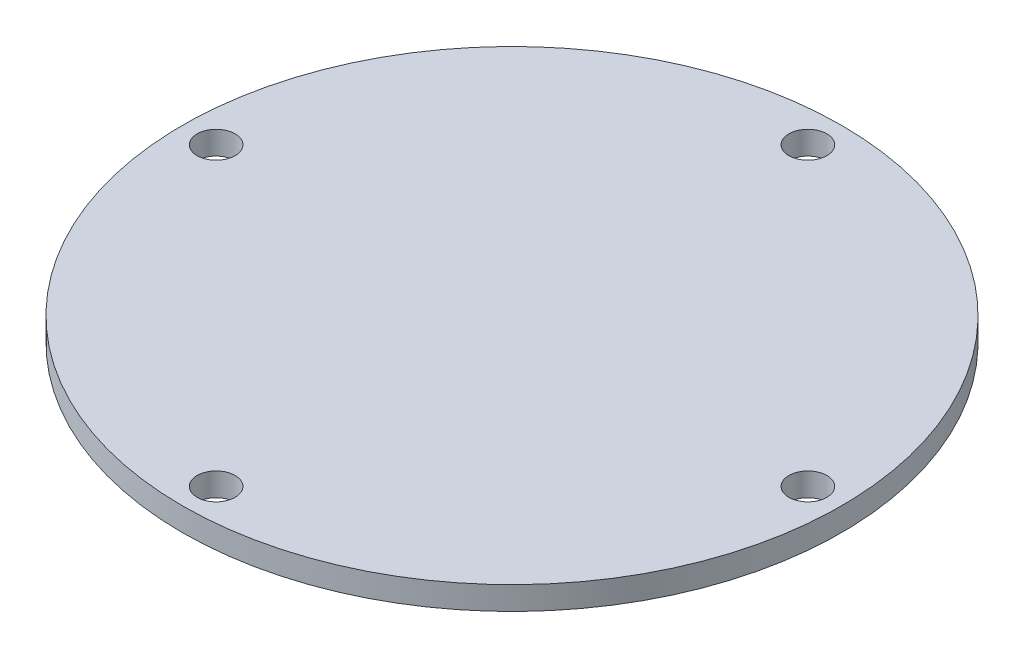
ISO-10303-21;
HEADER;
FILE_DESCRIPTION(('STEP AP214'),'2;1');
FILE_NAME('part.step','',(''),(''),'','','');
FILE_SCHEMA(('AUTOMOTIVE_DESIGN { 1 0 10303 214 1 1 1 1 }'));
ENDSEC;
DATA;
#1=APPLICATION_CONTEXT('core data for automotive mechanical design processes');
#2=APPLICATION_PROTOCOL_DEFINITION('international standard','automotive_design',2000,#1);
#3=PRODUCT_CONTEXT('',#1,'mechanical');
#4=PRODUCT('Part','Part','',(#3));
#5=PRODUCT_RELATED_PRODUCT_CATEGORY('part','',(#4));
#6=PRODUCT_DEFINITION_FORMATION('','',#4);
#7=PRODUCT_DEFINITION_CONTEXT('part definition',#1,'design');
#8=PRODUCT_DEFINITION('design','',#6,#7);
#9=PRODUCT_DEFINITION_SHAPE('','',#8);
#10=(LENGTH_UNIT() NAMED_UNIT(*) SI_UNIT(.MILLI.,.METRE.));
#11=(NAMED_UNIT(*) PLANE_ANGLE_UNIT() SI_UNIT($,.RADIAN.));
#12=(NAMED_UNIT(*) SI_UNIT($,.STERADIAN.) SOLID_ANGLE_UNIT());
#13=UNCERTAINTY_MEASURE_WITH_UNIT(LENGTH_MEASURE(1.E-05),#10,'distance_accuracy_value','');
#14=(GEOMETRIC_REPRESENTATION_CONTEXT(3) GLOBAL_UNCERTAINTY_ASSIGNED_CONTEXT((#13)) GLOBAL_UNIT_ASSIGNED_CONTEXT((#10,
#11,#12)) REPRESENTATION_CONTEXT('',''));
#15=CARTESIAN_POINT('',(0.,0.,0.));
#16=DIRECTION('',(0.,0.,1.));
#17=DIRECTION('',(1.,0.,0.));
#18=AXIS2_PLACEMENT_3D('',#15,#16,#17);
#19=CARTESIAN_POINT('',(0.,3.175,0.));
#20=DIRECTION('',(0.,-1.,0.));
#21=DIRECTION('',(0.,0.,-1.));
#22=AXIS2_PLACEMENT_3D('',#19,#20,#21);
#23=CYLINDRICAL_SURFACE('',#22,45.);
#24=CARTESIAN_POINT('',(0.,3.175,0.));
#25=DIRECTION('',(0.,1.,0.));
#26=DIRECTION('',(0.,0.,1.));
#27=AXIS2_PLACEMENT_3D('',#24,#25,#26);
#28=CIRCLE('',#27,45.);
#29=CARTESIAN_POINT('',(0.,3.175,45.));
#30=VERTEX_POINT('',#29);
#31=EDGE_CURVE('E10',#30,#30,#28,.T.);
#32=ORIENTED_EDGE('',*,*,#31,.F.);
#33=EDGE_LOOP('',(#32));
#34=FACE_BOUND('',#33,.T.);
#35=CARTESIAN_POINT('',(0.,0.,0.));
#36=DIRECTION('',(0.,1.,0.));
#37=DIRECTION('',(0.,0.,1.));
#38=AXIS2_PLACEMENT_3D('',#35,#36,#37);
#39=CIRCLE('',#38,45.);
#40=CARTESIAN_POINT('',(0.,0.,45.));
#41=VERTEX_POINT('',#40);
#42=EDGE_CURVE('E37',#41,#41,#39,.T.);
#43=ORIENTED_EDGE('',*,*,#42,.T.);
#44=EDGE_LOOP('',(#43));
#45=FACE_BOUND('',#44,.T.);
#46=ADVANCED_FACE('F30',(#34,#45),#23,.T.);
#47=CARTESIAN_POINT('',(0.,3.175,0.));
#48=DIRECTION('',(0.,1.,0.));
#49=DIRECTION('',(0.,0.,1.));
#50=AXIS2_PLACEMENT_3D('',#47,#48,#49);
#51=PLANE('',#50);
#52=CARTESIAN_POINT('',(4.23167538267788E-13,3.175,-40.4));
#53=DIRECTION('',(0.,1.,0.));
#54=DIRECTION('',(0.,0.,1.));
#55=AXIS2_PLACEMENT_3D('',#52,#53,#54);
#56=CIRCLE('',#55,2.59079999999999);
#57=CARTESIAN_POINT('',(4.23167538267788E-13,3.175,-37.8092));
#58=VERTEX_POINT('',#57);
#59=EDGE_CURVE('E60',#58,#58,#56,.T.);
#60=ORIENTED_EDGE('',*,*,#59,.F.);
#61=EDGE_LOOP('',(#60));
#62=FACE_BOUND('',#61,.T.);
#63=CARTESIAN_POINT('',(-40.4,3.175,0.));
#64=DIRECTION('',(0.,1.,0.));
#65=DIRECTION('',(0.,0.,1.));
#66=AXIS2_PLACEMENT_3D('',#63,#64,#65);
#67=CIRCLE('',#66,2.59079999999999);
#68=CARTESIAN_POINT('',(-40.4,3.175,2.59079999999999));
#69=VERTEX_POINT('',#68);
#70=EDGE_CURVE('E49',#69,#69,#67,.T.);
#71=ORIENTED_EDGE('',*,*,#70,.F.);
#72=EDGE_LOOP('',(#71));
#73=FACE_BOUND('',#72,.T.);
#74=CARTESIAN_POINT('',(-1.41055846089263E-13,3.175,40.4));
#75=DIRECTION('',(0.,1.,0.));
#76=DIRECTION('',(0.,0.,1.));
#77=AXIS2_PLACEMENT_3D('',#74,#75,#76);
#78=CIRCLE('',#77,2.59079999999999);
#79=CARTESIAN_POINT('',(-1.41055846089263E-13,3.175,42.9908));
#80=VERTEX_POINT('',#79);
#81=EDGE_CURVE('E48',#80,#80,#78,.T.);
#82=ORIENTED_EDGE('',*,*,#81,.F.);
#83=EDGE_LOOP('',(#82));
#84=FACE_BOUND('',#83,.T.);
#85=CARTESIAN_POINT('',(40.4,3.175,0.));
#86=DIRECTION('',(0.,1.,0.));
#87=DIRECTION('',(0.,0.,1.));
#88=AXIS2_PLACEMENT_3D('',#85,#86,#87);
#89=CIRCLE('',#88,2.59079999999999);
#90=CARTESIAN_POINT('',(40.4,3.175,2.59079999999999));
#91=VERTEX_POINT('',#90);
#92=EDGE_CURVE('E64',#91,#91,#89,.T.);
#93=ORIENTED_EDGE('',*,*,#92,.F.);
#94=EDGE_LOOP('',(#93));
#95=FACE_BOUND('',#94,.T.);
#96=ORIENTED_EDGE('',*,*,#31,.T.);
#97=EDGE_LOOP('',(#96));
#98=FACE_BOUND('',#97,.T.);
#99=ADVANCED_FACE('F85',(#62,#73,#84,#95,#98),#51,.T.);
#100=CARTESIAN_POINT('',(0.,0.,0.));
#101=DIRECTION('',(0.,1.,0.));
#102=DIRECTION('',(0.,0.,1.));
#103=AXIS2_PLACEMENT_3D('',#100,#101,#102);
#104=PLANE('',#103);
#105=CARTESIAN_POINT('',(4.23167538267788E-13,0.,-40.4));
#106=DIRECTION('',(0.,1.,0.));
#107=DIRECTION('',(0.,0.,1.));
#108=AXIS2_PLACEMENT_3D('',#105,#106,#107);
#109=CIRCLE('',#108,2.59079999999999);
#110=CARTESIAN_POINT('',(4.23167538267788E-13,0.,-37.8092));
#111=VERTEX_POINT('',#110);
#112=EDGE_CURVE('E33',#111,#111,#109,.T.);
#113=ORIENTED_EDGE('',*,*,#112,.T.);
#114=EDGE_LOOP('',(#113));
#115=FACE_BOUND('',#114,.T.);
#116=CARTESIAN_POINT('',(-40.4,0.,0.));
#117=DIRECTION('',(0.,1.,0.));
#118=DIRECTION('',(0.,0.,1.));
#119=AXIS2_PLACEMENT_3D('',#116,#117,#118);
#120=CIRCLE('',#119,2.59079999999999);
#121=CARTESIAN_POINT('',(-40.4,0.,2.59079999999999));
#122=VERTEX_POINT('',#121);
#123=EDGE_CURVE('E46',#122,#122,#120,.T.);
#124=ORIENTED_EDGE('',*,*,#123,.T.);
#125=EDGE_LOOP('',(#124));
#126=FACE_BOUND('',#125,.T.);
#127=CARTESIAN_POINT('',(-1.41055846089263E-13,0.,40.4));
#128=DIRECTION('',(0.,1.,0.));
#129=DIRECTION('',(0.,0.,1.));
#130=AXIS2_PLACEMENT_3D('',#127,#128,#129);
#131=CIRCLE('',#130,2.59079999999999);
#132=CARTESIAN_POINT('',(-1.41055846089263E-13,0.,42.9908));
#133=VERTEX_POINT('',#132);
#134=EDGE_CURVE('E53',#133,#133,#131,.T.);
#135=ORIENTED_EDGE('',*,*,#134,.T.);
#136=EDGE_LOOP('',(#135));
#137=FACE_BOUND('',#136,.T.);
#138=CARTESIAN_POINT('',(40.4,0.,0.));
#139=DIRECTION('',(0.,1.,0.));
#140=DIRECTION('',(0.,0.,1.));
#141=AXIS2_PLACEMENT_3D('',#138,#139,#140);
#142=CIRCLE('',#141,2.59079999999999);
#143=CARTESIAN_POINT('',(40.4,0.,2.59079999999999));
#144=VERTEX_POINT('',#143);
#145=EDGE_CURVE('E42',#144,#144,#142,.T.);
#146=ORIENTED_EDGE('',*,*,#145,.T.);
#147=EDGE_LOOP('',(#146));
#148=FACE_BOUND('',#147,.T.);
#149=ORIENTED_EDGE('',*,*,#42,.F.);
#150=EDGE_LOOP('',(#149));
#151=FACE_BOUND('',#150,.T.);
#152=ADVANCED_FACE('F71',(#115,#126,#137,#148,#151),#104,.F.);
#153=CARTESIAN_POINT('',(40.4,3.175,0.));
#154=DIRECTION('',(0.,1.,0.));
#155=DIRECTION('',(0.,0.,1.));
#156=AXIS2_PLACEMENT_3D('',#153,#154,#155);
#157=CYLINDRICAL_SURFACE('',#156,2.59079999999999);
#158=ORIENTED_EDGE('',*,*,#92,.T.);
#159=EDGE_LOOP('',(#158));
#160=FACE_BOUND('',#159,.T.);
#161=ORIENTED_EDGE('',*,*,#145,.F.);
#162=EDGE_LOOP('',(#161));
#163=FACE_BOUND('',#162,.T.);
#164=ADVANCED_FACE('F74',(#160,#163),#157,.F.);
#165=CARTESIAN_POINT('',(-1.41055846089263E-13,3.175,40.4));
#166=DIRECTION('',(0.,1.,0.));
#167=DIRECTION('',(0.,0.,1.));
#168=AXIS2_PLACEMENT_3D('',#165,#166,#167);
#169=CYLINDRICAL_SURFACE('',#168,2.59079999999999);
#170=ORIENTED_EDGE('',*,*,#81,.T.);
#171=EDGE_LOOP('',(#170));
#172=FACE_BOUND('',#171,.T.);
#173=ORIENTED_EDGE('',*,*,#134,.F.);
#174=EDGE_LOOP('',(#173));
#175=FACE_BOUND('',#174,.T.);
#176=ADVANCED_FACE('F76',(#172,#175),#169,.F.);
#177=CARTESIAN_POINT('',(-40.4,3.175,0.));
#178=DIRECTION('',(0.,1.,0.));
#179=DIRECTION('',(0.,0.,1.));
#180=AXIS2_PLACEMENT_3D('',#177,#178,#179);
#181=CYLINDRICAL_SURFACE('',#180,2.59079999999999);
#182=ORIENTED_EDGE('',*,*,#70,.T.);
#183=EDGE_LOOP('',(#182));
#184=FACE_BOUND('',#183,.T.);
#185=ORIENTED_EDGE('',*,*,#123,.F.);
#186=EDGE_LOOP('',(#185));
#187=FACE_BOUND('',#186,.T.);
#188=ADVANCED_FACE('F82',(#184,#187),#181,.F.);
#189=CARTESIAN_POINT('',(4.23167538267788E-13,3.175,-40.4));
#190=DIRECTION('',(0.,1.,0.));
#191=DIRECTION('',(0.,0.,1.));
#192=AXIS2_PLACEMENT_3D('',#189,#190,#191);
#193=CYLINDRICAL_SURFACE('',#192,2.59079999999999);
#194=ORIENTED_EDGE('',*,*,#59,.T.);
#195=EDGE_LOOP('',(#194));
#196=FACE_BOUND('',#195,.T.);
#197=ORIENTED_EDGE('',*,*,#112,.F.);
#198=EDGE_LOOP('',(#197));
#199=FACE_BOUND('',#198,.T.);
#200=ADVANCED_FACE('F108',(#196,#199),#193,.F.);
#201=CLOSED_SHELL('',(#46,#99,#152,#164,#176,#188,#200));
#202=MANIFOLD_SOLID_BREP('B2',#201);
#203=ADVANCED_BREP_SHAPE_REPRESENTATION('',(#18,#202),#14);
#204=SHAPE_DEFINITION_REPRESENTATION(#9,#203);
ENDSEC;
END-ISO-10303-21;
